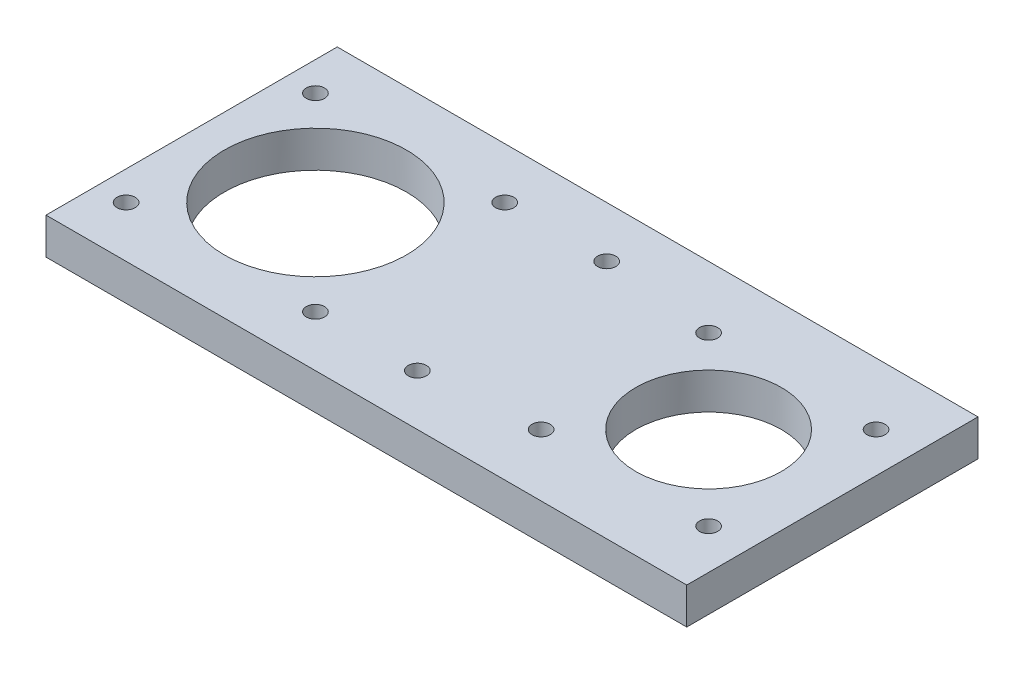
ISO-10303-21;
HEADER;
FILE_DESCRIPTION(('STEP AP214'),'2;1');
FILE_NAME('part.step','',(''),(''),'','','');
FILE_SCHEMA(('AUTOMOTIVE_DESIGN { 1 0 10303 214 1 1 1 1 }'));
ENDSEC;
DATA;
#1=APPLICATION_CONTEXT('core data for automotive mechanical design processes');
#2=APPLICATION_PROTOCOL_DEFINITION('international standard','automotive_design',2000,#1);
#3=PRODUCT_CONTEXT('',#1,'mechanical');
#4=PRODUCT('Part','Part','',(#3));
#5=PRODUCT_RELATED_PRODUCT_CATEGORY('part','',(#4));
#6=PRODUCT_DEFINITION_FORMATION('','',#4);
#7=PRODUCT_DEFINITION_CONTEXT('part definition',#1,'design');
#8=PRODUCT_DEFINITION('design','',#6,#7);
#9=PRODUCT_DEFINITION_SHAPE('','',#8);
#10=(LENGTH_UNIT() NAMED_UNIT(*) SI_UNIT(.MILLI.,.METRE.));
#11=(NAMED_UNIT(*) PLANE_ANGLE_UNIT() SI_UNIT($,.RADIAN.));
#12=(NAMED_UNIT(*) SI_UNIT($,.STERADIAN.) SOLID_ANGLE_UNIT());
#13=UNCERTAINTY_MEASURE_WITH_UNIT(LENGTH_MEASURE(1.E-05),#10,'distance_accuracy_value','');
#14=(GEOMETRIC_REPRESENTATION_CONTEXT(3) GLOBAL_UNCERTAINTY_ASSIGNED_CONTEXT((#13)) GLOBAL_UNIT_ASSIGNED_CONTEXT((#10,
#11,#12)) REPRESENTATION_CONTEXT('',''));
#15=CARTESIAN_POINT('',(0.,0.,0.));
#16=DIRECTION('',(0.,0.,1.));
#17=DIRECTION('',(1.,0.,0.));
#18=AXIS2_PLACEMENT_3D('',#15,#16,#17);
#19=CARTESIAN_POINT('',(0.,5.,0.));
#20=DIRECTION('',(1.,0.,0.));
#21=DIRECTION('',(0.,0.,-1.));
#22=AXIS2_PLACEMENT_3D('',#19,#20,#21);
#23=PLANE('',#22);
#24=DIRECTION('',(0.,0.,1.));
#25=VECTOR('',#24,1.);
#26=CARTESIAN_POINT('',(0.,0.,0.));
#27=LINE('',#26,#25);
#28=CARTESIAN_POINT('',(0.,0.,-40.));
#29=VERTEX_POINT('',#28);
#30=CARTESIAN_POINT('',(0.,0.,0.));
#31=VERTEX_POINT('',#30);
#32=EDGE_CURVE('E103',#29,#31,#27,.T.);
#33=ORIENTED_EDGE('',*,*,#32,.T.);
#34=DIRECTION('',(0.,-1.,0.));
#35=VECTOR('',#34,1.);
#36=CARTESIAN_POINT('',(0.,5.,0.));
#37=LINE('',#36,#35);
#38=CARTESIAN_POINT('',(0.,5.,0.));
#39=VERTEX_POINT('',#38);
#40=EDGE_CURVE('E11',#39,#31,#37,.T.);
#41=ORIENTED_EDGE('',*,*,#40,.F.);
#42=DIRECTION('',(0.,0.,1.));
#43=VECTOR('',#42,1.);
#44=CARTESIAN_POINT('',(0.,5.,0.));
#45=LINE('',#44,#43);
#46=CARTESIAN_POINT('',(0.,5.,-40.));
#47=VERTEX_POINT('',#46);
#48=EDGE_CURVE('E90',#47,#39,#45,.T.);
#49=ORIENTED_EDGE('',*,*,#48,.F.);
#50=DIRECTION('',(0.,-1.,0.));
#51=VECTOR('',#50,1.);
#52=CARTESIAN_POINT('',(0.,5.,-40.));
#53=LINE('',#52,#51);
#54=EDGE_CURVE('E99',#47,#29,#53,.T.);
#55=ORIENTED_EDGE('',*,*,#54,.T.);
#56=EDGE_LOOP('',(#33,#41,#49,#55));
#57=FACE_BOUND('',#56,.T.);
#58=ADVANCED_FACE('F37',(#57),#23,.F.);
#59=CARTESIAN_POINT('',(0.,5.,0.));
#60=DIRECTION('',(0.,0.,-1.));
#61=DIRECTION('',(-1.,0.,0.));
#62=AXIS2_PLACEMENT_3D('',#59,#60,#61);
#63=PLANE('',#62);
#64=DIRECTION('',(1.,0.,0.));
#65=VECTOR('',#64,1.);
#66=CARTESIAN_POINT('',(0.,0.,0.));
#67=LINE('',#66,#65);
#68=CARTESIAN_POINT('',(88.,0.,0.));
#69=VERTEX_POINT('',#68);
#70=EDGE_CURVE('E94',#31,#69,#67,.T.);
#71=ORIENTED_EDGE('',*,*,#70,.T.);
#72=DIRECTION('',(0.,-1.,0.));
#73=VECTOR('',#72,1.);
#74=CARTESIAN_POINT('',(88.,5.,0.));
#75=LINE('',#74,#73);
#76=CARTESIAN_POINT('',(88.,5.,0.));
#77=VERTEX_POINT('',#76);
#78=EDGE_CURVE('E46',#77,#69,#75,.T.);
#79=ORIENTED_EDGE('',*,*,#78,.F.);
#80=DIRECTION('',(1.,0.,0.));
#81=VECTOR('',#80,1.);
#82=CARTESIAN_POINT('',(0.,5.,0.));
#83=LINE('',#82,#81);
#84=EDGE_CURVE('E85',#39,#77,#83,.T.);
#85=ORIENTED_EDGE('',*,*,#84,.F.);
#86=ORIENTED_EDGE('',*,*,#40,.T.);
#87=EDGE_LOOP('',(#71,#79,#85,#86));
#88=FACE_BOUND('',#87,.T.);
#89=ADVANCED_FACE('F93',(#88),#63,.F.);
#90=CARTESIAN_POINT('',(88.,5.,0.));
#91=DIRECTION('',(-1.,0.,0.));
#92=DIRECTION('',(0.,0.,1.));
#93=AXIS2_PLACEMENT_3D('',#90,#91,#92);
#94=PLANE('',#93);
#95=DIRECTION('',(0.,0.,-1.));
#96=VECTOR('',#95,1.);
#97=CARTESIAN_POINT('',(88.,0.,0.));
#98=LINE('',#97,#96);
#99=CARTESIAN_POINT('',(88.,0.,-40.));
#100=VERTEX_POINT('',#99);
#101=EDGE_CURVE('E72',#69,#100,#98,.T.);
#102=ORIENTED_EDGE('',*,*,#101,.T.);
#103=DIRECTION('',(0.,-1.,0.));
#104=VECTOR('',#103,1.);
#105=CARTESIAN_POINT('',(88.,5.,-40.));
#106=LINE('',#105,#104);
#107=CARTESIAN_POINT('',(88.,5.,-40.));
#108=VERTEX_POINT('',#107);
#109=EDGE_CURVE('E95',#108,#100,#106,.T.);
#110=ORIENTED_EDGE('',*,*,#109,.F.);
#111=DIRECTION('',(0.,0.,-1.));
#112=VECTOR('',#111,1.);
#113=CARTESIAN_POINT('',(88.,5.,0.));
#114=LINE('',#113,#112);
#115=EDGE_CURVE('E88',#77,#108,#114,.T.);
#116=ORIENTED_EDGE('',*,*,#115,.F.);
#117=ORIENTED_EDGE('',*,*,#78,.T.);
#118=EDGE_LOOP('',(#102,#110,#116,#117));
#119=FACE_BOUND('',#118,.T.);
#120=ADVANCED_FACE('F97',(#119),#94,.F.);
#121=CARTESIAN_POINT('',(0.,5.,-40.));
#122=DIRECTION('',(0.,0.,1.));
#123=DIRECTION('',(1.,0.,0.));
#124=AXIS2_PLACEMENT_3D('',#121,#122,#123);
#125=PLANE('',#124);
#126=DIRECTION('',(-1.,0.,0.));
#127=VECTOR('',#126,1.);
#128=CARTESIAN_POINT('',(0.,0.,-40.));
#129=LINE('',#128,#127);
#130=EDGE_CURVE('E78',#100,#29,#129,.T.);
#131=ORIENTED_EDGE('',*,*,#130,.T.);
#132=ORIENTED_EDGE('',*,*,#54,.F.);
#133=DIRECTION('',(-1.,0.,0.));
#134=VECTOR('',#133,1.);
#135=CARTESIAN_POINT('',(0.,5.,-40.));
#136=LINE('',#135,#134);
#137=EDGE_CURVE('E55',#108,#47,#136,.T.);
#138=ORIENTED_EDGE('',*,*,#137,.F.);
#139=ORIENTED_EDGE('',*,*,#109,.T.);
#140=EDGE_LOOP('',(#131,#132,#138,#139));
#141=FACE_BOUND('',#140,.T.);
#142=ADVANCED_FACE('F188',(#141),#125,.F.);
#143=CARTESIAN_POINT('',(0.,5.,0.));
#144=DIRECTION('',(0.,-1.,0.));
#145=DIRECTION('',(0.,0.,-1.));
#146=AXIS2_PLACEMENT_3D('',#143,#144,#145);
#147=PLANE('',#146);
#148=CARTESIAN_POINT('',(82.4999999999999,5.,-31.5000000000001));
#149=DIRECTION('',(0.,1.,0.));
#150=DIRECTION('',(-1.,0.,0.));
#151=AXIS2_PLACEMENT_3D('',#148,#149,#150);
#152=CIRCLE('',#151,1.25);
#153=CARTESIAN_POINT('',(81.2499999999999,5.,-31.5000000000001));
#154=VERTEX_POINT('',#153);
#155=EDGE_CURVE('E156',#154,#154,#152,.T.);
#156=ORIENTED_EDGE('',*,*,#155,.F.);
#157=EDGE_LOOP('',(#156));
#158=FACE_BOUND('',#157,.T.);
#159=CARTESIAN_POINT('',(82.5,5.,-8.5));
#160=DIRECTION('',(0.,1.,0.));
#161=DIRECTION('',(0.,0.,-1.));
#162=AXIS2_PLACEMENT_3D('',#159,#160,#161);
#163=CIRCLE('',#162,1.25);
#164=CARTESIAN_POINT('',(82.5,5.,-9.75));
#165=VERTEX_POINT('',#164);
#166=EDGE_CURVE('E146',#165,#165,#163,.T.);
#167=ORIENTED_EDGE('',*,*,#166,.F.);
#168=EDGE_LOOP('',(#167));
#169=FACE_BOUND('',#168,.T.);
#170=CARTESIAN_POINT('',(59.5,5.,-8.49999999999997));
#171=DIRECTION('',(0.,1.,0.));
#172=DIRECTION('',(1.,0.,0.));
#173=AXIS2_PLACEMENT_3D('',#170,#171,#172);
#174=CIRCLE('',#173,1.25);
#175=CARTESIAN_POINT('',(60.75,5.,-8.49999999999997));
#176=VERTEX_POINT('',#175);
#177=EDGE_CURVE('E143',#176,#176,#174,.T.);
#178=ORIENTED_EDGE('',*,*,#177,.F.);
#179=EDGE_LOOP('',(#178));
#180=FACE_BOUND('',#179,.T.);
#181=CARTESIAN_POINT('',(59.5,5.,-31.5));
#182=DIRECTION('',(0.,1.,0.));
#183=DIRECTION('',(0.,0.,1.));
#184=AXIS2_PLACEMENT_3D('',#181,#182,#183);
#185=CIRCLE('',#184,1.25);
#186=CARTESIAN_POINT('',(59.5,5.,-30.25));
#187=VERTEX_POINT('',#186);
#188=EDGE_CURVE('E140',#187,#187,#185,.T.);
#189=ORIENTED_EDGE('',*,*,#188,.F.);
#190=EDGE_LOOP('',(#189));
#191=FACE_BOUND('',#190,.T.);
#192=CARTESIAN_POINT('',(71.,5.,-20.));
#193=DIRECTION('',(0.,1.,0.));
#194=DIRECTION('',(0.,0.,1.));
#195=AXIS2_PLACEMENT_3D('',#192,#193,#194);
#196=CIRCLE('',#195,9.99999999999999);
#197=CARTESIAN_POINT('',(71.,5.,-10.));
#198=VERTEX_POINT('',#197);
#199=EDGE_CURVE('E136',#198,#198,#196,.T.);
#200=ORIENTED_EDGE('',*,*,#199,.F.);
#201=EDGE_LOOP('',(#200));
#202=FACE_BOUND('',#201,.T.);
#203=CARTESIAN_POINT('',(29.9999999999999,5.,-33.0000000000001));
#204=DIRECTION('',(0.,1.,0.));
#205=DIRECTION('',(-1.,0.,0.));
#206=AXIS2_PLACEMENT_3D('',#203,#204,#205);
#207=CIRCLE('',#206,1.25);
#208=CARTESIAN_POINT('',(28.7499999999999,5.,-33.0000000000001));
#209=VERTEX_POINT('',#208);
#210=EDGE_CURVE('E132',#209,#209,#207,.T.);
#211=ORIENTED_EDGE('',*,*,#210,.F.);
#212=EDGE_LOOP('',(#211));
#213=FACE_BOUND('',#212,.T.);
#214=CARTESIAN_POINT('',(30.,5.,-7.));
#215=DIRECTION('',(0.,1.,0.));
#216=DIRECTION('',(0.,0.,-1.));
#217=AXIS2_PLACEMENT_3D('',#214,#215,#216);
#218=CIRCLE('',#217,1.25);
#219=CARTESIAN_POINT('',(30.,5.,-8.25));
#220=VERTEX_POINT('',#219);
#221=EDGE_CURVE('E128',#220,#220,#218,.T.);
#222=ORIENTED_EDGE('',*,*,#221,.F.);
#223=EDGE_LOOP('',(#222));
#224=FACE_BOUND('',#223,.T.);
#225=CARTESIAN_POINT('',(4.00000000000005,5.,-6.99999999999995));
#226=DIRECTION('',(0.,1.,0.));
#227=DIRECTION('',(1.,0.,0.));
#228=AXIS2_PLACEMENT_3D('',#225,#226,#227);
#229=CIRCLE('',#228,1.25);
#230=CARTESIAN_POINT('',(5.25000000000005,5.,-6.99999999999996));
#231=VERTEX_POINT('',#230);
#232=EDGE_CURVE('E124',#231,#231,#229,.T.);
#233=ORIENTED_EDGE('',*,*,#232,.F.);
#234=EDGE_LOOP('',(#233));
#235=FACE_BOUND('',#234,.T.);
#236=CARTESIAN_POINT('',(4.,5.,-33.));
#237=DIRECTION('',(0.,1.,0.));
#238=DIRECTION('',(0.,0.,1.));
#239=AXIS2_PLACEMENT_3D('',#236,#237,#238);
#240=CIRCLE('',#239,1.25);
#241=CARTESIAN_POINT('',(4.,5.,-31.75));
#242=VERTEX_POINT('',#241);
#243=EDGE_CURVE('E120',#242,#242,#240,.T.);
#244=ORIENTED_EDGE('',*,*,#243,.F.);
#245=EDGE_LOOP('',(#244));
#246=FACE_BOUND('',#245,.T.);
#247=CARTESIAN_POINT('',(17.,5.,-20.));
#248=DIRECTION('',(0.,1.,0.));
#249=DIRECTION('',(0.,0.,1.));
#250=AXIS2_PLACEMENT_3D('',#247,#248,#249);
#251=CIRCLE('',#250,12.5);
#252=CARTESIAN_POINT('',(17.,5.,-7.5));
#253=VERTEX_POINT('',#252);
#254=EDGE_CURVE('E116',#253,#253,#251,.T.);
#255=ORIENTED_EDGE('',*,*,#254,.F.);
#256=EDGE_LOOP('',(#255));
#257=FACE_BOUND('',#256,.T.);
#258=CARTESIAN_POINT('',(44.,5.,-7.));
#259=DIRECTION('',(0.,1.,0.));
#260=DIRECTION('',(0.,0.,1.));
#261=AXIS2_PLACEMENT_3D('',#258,#259,#260);
#262=CIRCLE('',#261,1.25);
#263=CARTESIAN_POINT('',(44.,5.,-5.75000000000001));
#264=VERTEX_POINT('',#263);
#265=EDGE_CURVE('E115',#264,#264,#262,.T.);
#266=ORIENTED_EDGE('',*,*,#265,.F.);
#267=EDGE_LOOP('',(#266));
#268=FACE_BOUND('',#267,.T.);
#269=CARTESIAN_POINT('',(44.,5.,-33.));
#270=DIRECTION('',(0.,1.,0.));
#271=DIRECTION('',(0.,0.,1.));
#272=AXIS2_PLACEMENT_3D('',#269,#270,#271);
#273=CIRCLE('',#272,1.25);
#274=CARTESIAN_POINT('',(44.,5.,-31.75));
#275=VERTEX_POINT('',#274);
#276=EDGE_CURVE('E176',#275,#275,#273,.T.);
#277=ORIENTED_EDGE('',*,*,#276,.F.);
#278=EDGE_LOOP('',(#277));
#279=FACE_BOUND('',#278,.T.);
#280=ORIENTED_EDGE('',*,*,#48,.T.);
#281=ORIENTED_EDGE('',*,*,#84,.T.);
#282=ORIENTED_EDGE('',*,*,#115,.T.);
#283=ORIENTED_EDGE('',*,*,#137,.T.);
#284=EDGE_LOOP('',(#280,#281,#282,#283));
#285=FACE_BOUND('',#284,.T.);
#286=ADVANCED_FACE('F86',(#158,#169,#180,#191,#202,#213,#224,#235,#246,#257,#268,#279,#285),
#147,.F.);
#287=CARTESIAN_POINT('',(0.,0.,0.));
#288=DIRECTION('',(0.,-1.,0.));
#289=DIRECTION('',(0.,0.,-1.));
#290=AXIS2_PLACEMENT_3D('',#287,#288,#289);
#291=PLANE('',#290);
#292=CARTESIAN_POINT('',(82.4999999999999,0.,-31.5000000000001));
#293=DIRECTION('',(0.,-1.,0.));
#294=DIRECTION('',(0.,0.,-1.));
#295=AXIS2_PLACEMENT_3D('',#292,#293,#294);
#296=CIRCLE('',#295,1.25);
#297=CARTESIAN_POINT('',(82.4999999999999,0.,-32.7500000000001));
#298=VERTEX_POINT('',#297);
#299=EDGE_CURVE('E40',#298,#298,#296,.T.);
#300=ORIENTED_EDGE('',*,*,#299,.F.);
#301=EDGE_LOOP('',(#300));
#302=FACE_BOUND('',#301,.T.);
#303=CARTESIAN_POINT('',(82.5,0.,-8.5));
#304=DIRECTION('',(0.,-1.,0.));
#305=DIRECTION('',(0.,0.,-1.));
#306=AXIS2_PLACEMENT_3D('',#303,#304,#305);
#307=CIRCLE('',#306,1.25);
#308=CARTESIAN_POINT('',(82.5,0.,-9.75));
#309=VERTEX_POINT('',#308);
#310=EDGE_CURVE('E144',#309,#309,#307,.T.);
#311=ORIENTED_EDGE('',*,*,#310,.F.);
#312=EDGE_LOOP('',(#311));
#313=FACE_BOUND('',#312,.T.);
#314=CARTESIAN_POINT('',(59.5,0.,-8.49999999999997));
#315=DIRECTION('',(0.,-1.,0.));
#316=DIRECTION('',(0.,0.,-1.));
#317=AXIS2_PLACEMENT_3D('',#314,#315,#316);
#318=CIRCLE('',#317,1.25);
#319=CARTESIAN_POINT('',(59.5,0.,-9.74999999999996));
#320=VERTEX_POINT('',#319);
#321=EDGE_CURVE('E141',#320,#320,#318,.T.);
#322=ORIENTED_EDGE('',*,*,#321,.F.);
#323=EDGE_LOOP('',(#322));
#324=FACE_BOUND('',#323,.T.);
#325=CARTESIAN_POINT('',(59.5,0.,-31.5));
#326=DIRECTION('',(0.,-1.,0.));
#327=DIRECTION('',(0.,0.,-1.));
#328=AXIS2_PLACEMENT_3D('',#325,#326,#327);
#329=CIRCLE('',#328,1.25);
#330=CARTESIAN_POINT('',(59.5,0.,-32.75));
#331=VERTEX_POINT('',#330);
#332=EDGE_CURVE('E137',#331,#331,#329,.T.);
#333=ORIENTED_EDGE('',*,*,#332,.F.);
#334=EDGE_LOOP('',(#333));
#335=FACE_BOUND('',#334,.T.);
#336=CARTESIAN_POINT('',(71.,0.,-20.));
#337=DIRECTION('',(0.,-1.,0.));
#338=DIRECTION('',(0.,0.,-1.));
#339=AXIS2_PLACEMENT_3D('',#336,#337,#338);
#340=CIRCLE('',#339,9.99999999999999);
#341=CARTESIAN_POINT('',(71.,0.,-30.));
#342=VERTEX_POINT('',#341);
#343=EDGE_CURVE('E133',#342,#342,#340,.T.);
#344=ORIENTED_EDGE('',*,*,#343,.F.);
#345=EDGE_LOOP('',(#344));
#346=FACE_BOUND('',#345,.T.);
#347=CARTESIAN_POINT('',(29.9999999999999,0.,-33.0000000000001));
#348=DIRECTION('',(0.,-1.,0.));
#349=DIRECTION('',(0.,0.,-1.));
#350=AXIS2_PLACEMENT_3D('',#347,#348,#349);
#351=CIRCLE('',#350,1.25);
#352=CARTESIAN_POINT('',(29.9999999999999,0.,-34.2500000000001));
#353=VERTEX_POINT('',#352);
#354=EDGE_CURVE('E129',#353,#353,#351,.T.);
#355=ORIENTED_EDGE('',*,*,#354,.F.);
#356=EDGE_LOOP('',(#355));
#357=FACE_BOUND('',#356,.T.);
#358=CARTESIAN_POINT('',(30.,0.,-7.));
#359=DIRECTION('',(0.,-1.,0.));
#360=DIRECTION('',(0.,0.,-1.));
#361=AXIS2_PLACEMENT_3D('',#358,#359,#360);
#362=CIRCLE('',#361,1.25);
#363=CARTESIAN_POINT('',(30.,0.,-8.25));
#364=VERTEX_POINT('',#363);
#365=EDGE_CURVE('E125',#364,#364,#362,.T.);
#366=ORIENTED_EDGE('',*,*,#365,.F.);
#367=EDGE_LOOP('',(#366));
#368=FACE_BOUND('',#367,.T.);
#369=CARTESIAN_POINT('',(4.00000000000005,0.,-6.99999999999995));
#370=DIRECTION('',(0.,-1.,0.));
#371=DIRECTION('',(0.,0.,-1.));
#372=AXIS2_PLACEMENT_3D('',#369,#370,#371);
#373=CIRCLE('',#372,1.25);
#374=CARTESIAN_POINT('',(4.00000000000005,0.,-8.24999999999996));
#375=VERTEX_POINT('',#374);
#376=EDGE_CURVE('E121',#375,#375,#373,.T.);
#377=ORIENTED_EDGE('',*,*,#376,.F.);
#378=EDGE_LOOP('',(#377));
#379=FACE_BOUND('',#378,.T.);
#380=CARTESIAN_POINT('',(4.,0.,-33.));
#381=DIRECTION('',(0.,-1.,0.));
#382=DIRECTION('',(0.,0.,-1.));
#383=AXIS2_PLACEMENT_3D('',#380,#381,#382);
#384=CIRCLE('',#383,1.25);
#385=CARTESIAN_POINT('',(4.,0.,-34.25));
#386=VERTEX_POINT('',#385);
#387=EDGE_CURVE('E117',#386,#386,#384,.T.);
#388=ORIENTED_EDGE('',*,*,#387,.F.);
#389=EDGE_LOOP('',(#388));
#390=FACE_BOUND('',#389,.T.);
#391=CARTESIAN_POINT('',(17.,0.,-20.));
#392=DIRECTION('',(0.,-1.,0.));
#393=DIRECTION('',(0.,0.,-1.));
#394=AXIS2_PLACEMENT_3D('',#391,#392,#393);
#395=CIRCLE('',#394,12.5);
#396=CARTESIAN_POINT('',(17.,0.,-32.5));
#397=VERTEX_POINT('',#396);
#398=EDGE_CURVE('E112',#397,#397,#395,.T.);
#399=ORIENTED_EDGE('',*,*,#398,.F.);
#400=EDGE_LOOP('',(#399));
#401=FACE_BOUND('',#400,.T.);
#402=CARTESIAN_POINT('',(44.,0.,-7.));
#403=DIRECTION('',(0.,1.,0.));
#404=DIRECTION('',(0.,0.,1.));
#405=AXIS2_PLACEMENT_3D('',#402,#403,#404);
#406=CIRCLE('',#405,1.25);
#407=CARTESIAN_POINT('',(44.,0.,-5.75000000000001));
#408=VERTEX_POINT('',#407);
#409=EDGE_CURVE('E173',#408,#408,#406,.T.);
#410=ORIENTED_EDGE('',*,*,#409,.T.);
#411=EDGE_LOOP('',(#410));
#412=FACE_BOUND('',#411,.T.);
#413=CARTESIAN_POINT('',(44.,0.,-33.));
#414=DIRECTION('',(0.,1.,0.));
#415=DIRECTION('',(0.,0.,1.));
#416=AXIS2_PLACEMENT_3D('',#413,#414,#415);
#417=CIRCLE('',#416,1.25);
#418=CARTESIAN_POINT('',(44.,0.,-31.75));
#419=VERTEX_POINT('',#418);
#420=EDGE_CURVE('E106',#419,#419,#417,.T.);
#421=ORIENTED_EDGE('',*,*,#420,.T.);
#422=EDGE_LOOP('',(#421));
#423=FACE_BOUND('',#422,.T.);
#424=ORIENTED_EDGE('',*,*,#32,.F.);
#425=ORIENTED_EDGE('',*,*,#130,.F.);
#426=ORIENTED_EDGE('',*,*,#101,.F.);
#427=ORIENTED_EDGE('',*,*,#70,.F.);
#428=EDGE_LOOP('',(#424,#425,#426,#427));
#429=FACE_BOUND('',#428,.T.);
#430=ADVANCED_FACE('F187',(#302,#313,#324,#335,#346,#357,#368,#379,#390,#401,#412,#423,#429),
#291,.T.);
#431=CARTESIAN_POINT('',(44.,0.,-33.));
#432=DIRECTION('',(0.,1.,0.));
#433=DIRECTION('',(0.,0.,1.));
#434=AXIS2_PLACEMENT_3D('',#431,#432,#433);
#435=CYLINDRICAL_SURFACE('',#434,1.25);
#436=ORIENTED_EDGE('',*,*,#420,.F.);
#437=EDGE_LOOP('',(#436));
#438=FACE_BOUND('',#437,.T.);
#439=ORIENTED_EDGE('',*,*,#276,.T.);
#440=EDGE_LOOP('',(#439));
#441=FACE_BOUND('',#440,.T.);
#442=ADVANCED_FACE('F184',(#438,#441),#435,.F.);
#443=CARTESIAN_POINT('',(44.,0.,-7.));
#444=DIRECTION('',(0.,1.,0.));
#445=DIRECTION('',(0.,0.,1.));
#446=AXIS2_PLACEMENT_3D('',#443,#444,#445);
#447=CYLINDRICAL_SURFACE('',#446,1.25);
#448=ORIENTED_EDGE('',*,*,#409,.F.);
#449=EDGE_LOOP('',(#448));
#450=FACE_BOUND('',#449,.T.);
#451=ORIENTED_EDGE('',*,*,#265,.T.);
#452=EDGE_LOOP('',(#451));
#453=FACE_BOUND('',#452,.T.);
#454=ADVANCED_FACE('F228',(#450,#453),#447,.F.);
#455=CARTESIAN_POINT('',(17.,-5.,-20.));
#456=DIRECTION('',(0.,1.,0.));
#457=DIRECTION('',(0.,0.,1.));
#458=AXIS2_PLACEMENT_3D('',#455,#456,#457);
#459=CYLINDRICAL_SURFACE('',#458,12.5);
#460=ORIENTED_EDGE('',*,*,#398,.T.);
#461=EDGE_LOOP('',(#460));
#462=FACE_BOUND('',#461,.T.);
#463=ORIENTED_EDGE('',*,*,#254,.T.);
#464=EDGE_LOOP('',(#463));
#465=FACE_BOUND('',#464,.T.);
#466=ADVANCED_FACE('F238',(#462,#465),#459,.F.);
#467=CARTESIAN_POINT('',(4.,-5.,-33.));
#468=DIRECTION('',(0.,1.,0.));
#469=DIRECTION('',(0.,0.,1.));
#470=AXIS2_PLACEMENT_3D('',#467,#468,#469);
#471=CYLINDRICAL_SURFACE('',#470,1.25);
#472=ORIENTED_EDGE('',*,*,#387,.T.);
#473=EDGE_LOOP('',(#472));
#474=FACE_BOUND('',#473,.T.);
#475=ORIENTED_EDGE('',*,*,#243,.T.);
#476=EDGE_LOOP('',(#475));
#477=FACE_BOUND('',#476,.T.);
#478=ADVANCED_FACE('F248',(#474,#477),#471,.F.);
#479=CARTESIAN_POINT('',(4.00000000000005,-5.,-6.99999999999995));
#480=DIRECTION('',(0.,1.,0.));
#481=DIRECTION('',(0.,0.,1.));
#482=AXIS2_PLACEMENT_3D('',#479,#480,#481);
#483=CYLINDRICAL_SURFACE('',#482,1.25);
#484=ORIENTED_EDGE('',*,*,#376,.T.);
#485=EDGE_LOOP('',(#484));
#486=FACE_BOUND('',#485,.T.);
#487=ORIENTED_EDGE('',*,*,#232,.T.);
#488=EDGE_LOOP('',(#487));
#489=FACE_BOUND('',#488,.T.);
#490=ADVANCED_FACE('F258',(#486,#489),#483,.F.);
#491=CARTESIAN_POINT('',(30.,-5.,-7.));
#492=DIRECTION('',(0.,1.,0.));
#493=DIRECTION('',(0.,0.,1.));
#494=AXIS2_PLACEMENT_3D('',#491,#492,#493);
#495=CYLINDRICAL_SURFACE('',#494,1.25);
#496=ORIENTED_EDGE('',*,*,#365,.T.);
#497=EDGE_LOOP('',(#496));
#498=FACE_BOUND('',#497,.T.);
#499=ORIENTED_EDGE('',*,*,#221,.T.);
#500=EDGE_LOOP('',(#499));
#501=FACE_BOUND('',#500,.T.);
#502=ADVANCED_FACE('F268',(#498,#501),#495,.F.);
#503=CARTESIAN_POINT('',(29.9999999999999,-5.,-33.0000000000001));
#504=DIRECTION('',(0.,1.,0.));
#505=DIRECTION('',(0.,0.,1.));
#506=AXIS2_PLACEMENT_3D('',#503,#504,#505);
#507=CYLINDRICAL_SURFACE('',#506,1.25);
#508=ORIENTED_EDGE('',*,*,#354,.T.);
#509=EDGE_LOOP('',(#508));
#510=FACE_BOUND('',#509,.T.);
#511=ORIENTED_EDGE('',*,*,#210,.T.);
#512=EDGE_LOOP('',(#511));
#513=FACE_BOUND('',#512,.T.);
#514=ADVANCED_FACE('F278',(#510,#513),#507,.F.);
#515=CARTESIAN_POINT('',(71.,-5.,-20.));
#516=DIRECTION('',(0.,1.,0.));
#517=DIRECTION('',(0.,0.,1.));
#518=AXIS2_PLACEMENT_3D('',#515,#516,#517);
#519=CYLINDRICAL_SURFACE('',#518,9.99999999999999);
#520=ORIENTED_EDGE('',*,*,#343,.T.);
#521=EDGE_LOOP('',(#520));
#522=FACE_BOUND('',#521,.T.);
#523=ORIENTED_EDGE('',*,*,#199,.T.);
#524=EDGE_LOOP('',(#523));
#525=FACE_BOUND('',#524,.T.);
#526=ADVANCED_FACE('F288',(#522,#525),#519,.F.);
#527=CARTESIAN_POINT('',(59.5,-5.,-31.5));
#528=DIRECTION('',(0.,1.,0.));
#529=DIRECTION('',(0.,0.,1.));
#530=AXIS2_PLACEMENT_3D('',#527,#528,#529);
#531=CYLINDRICAL_SURFACE('',#530,1.25);
#532=ORIENTED_EDGE('',*,*,#332,.T.);
#533=EDGE_LOOP('',(#532));
#534=FACE_BOUND('',#533,.T.);
#535=ORIENTED_EDGE('',*,*,#188,.T.);
#536=EDGE_LOOP('',(#535));
#537=FACE_BOUND('',#536,.T.);
#538=ADVANCED_FACE('F298',(#534,#537),#531,.F.);
#539=CARTESIAN_POINT('',(59.5,-5.,-8.49999999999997));
#540=DIRECTION('',(0.,1.,0.));
#541=DIRECTION('',(0.,0.,1.));
#542=AXIS2_PLACEMENT_3D('',#539,#540,#541);
#543=CYLINDRICAL_SURFACE('',#542,1.25);
#544=ORIENTED_EDGE('',*,*,#321,.T.);
#545=EDGE_LOOP('',(#544));
#546=FACE_BOUND('',#545,.T.);
#547=ORIENTED_EDGE('',*,*,#177,.T.);
#548=EDGE_LOOP('',(#547));
#549=FACE_BOUND('',#548,.T.);
#550=ADVANCED_FACE('F307',(#546,#549),#543,.F.);
#551=CARTESIAN_POINT('',(82.5,-5.,-8.5));
#552=DIRECTION('',(0.,1.,0.));
#553=DIRECTION('',(0.,0.,1.));
#554=AXIS2_PLACEMENT_3D('',#551,#552,#553);
#555=CYLINDRICAL_SURFACE('',#554,1.25);
#556=ORIENTED_EDGE('',*,*,#310,.T.);
#557=EDGE_LOOP('',(#556));
#558=FACE_BOUND('',#557,.T.);
#559=ORIENTED_EDGE('',*,*,#166,.T.);
#560=EDGE_LOOP('',(#559));
#561=FACE_BOUND('',#560,.T.);
#562=ADVANCED_FACE('F326',(#558,#561),#555,.F.);
#563=CARTESIAN_POINT('',(82.4999999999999,-5.,-31.5000000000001));
#564=DIRECTION('',(0.,1.,0.));
#565=DIRECTION('',(0.,0.,1.));
#566=AXIS2_PLACEMENT_3D('',#563,#564,#565);
#567=CYLINDRICAL_SURFACE('',#566,1.25);
#568=ORIENTED_EDGE('',*,*,#299,.T.);
#569=EDGE_LOOP('',(#568));
#570=FACE_BOUND('',#569,.T.);
#571=ORIENTED_EDGE('',*,*,#155,.T.);
#572=EDGE_LOOP('',(#571));
#573=FACE_BOUND('',#572,.T.);
#574=ADVANCED_FACE('F336',(#570,#573),#567,.F.);
#575=CLOSED_SHELL('',(#58,#89,#120,#142,#286,#430,#442,#454,#466,#478,#490,#502,#514,#526,#538,
#550,#562,#574));
#576=MANIFOLD_SOLID_BREP('B2',#575);
#577=ADVANCED_BREP_SHAPE_REPRESENTATION('',(#18,#576),#14);
#578=SHAPE_DEFINITION_REPRESENTATION(#9,#577);
ENDSEC;
END-ISO-10303-21;
